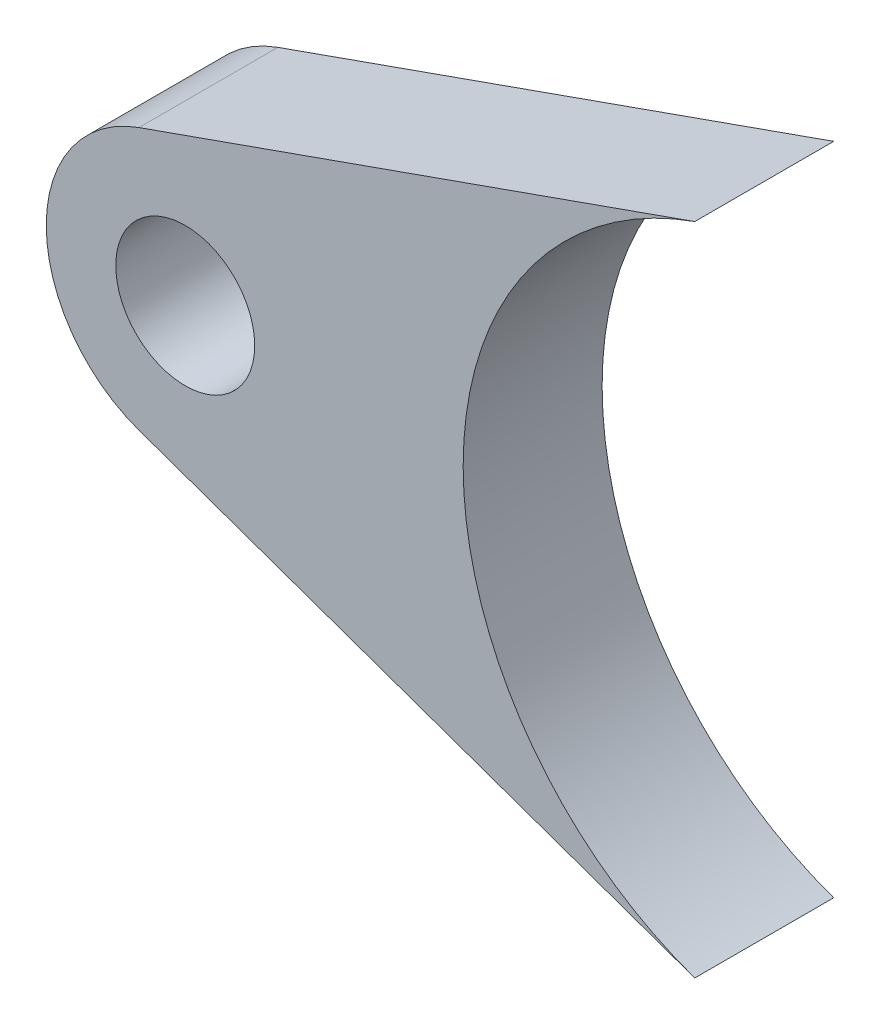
from build123d import *

# Parameters (mm, degrees)
SKETCH_1_R      = 10
EXTRUDE_1_DEPTH = 20


with BuildPart() as part:
    # Sketch 1 → Extrude 1 (new body)
    with BuildSketch(Plane.XY):
        with BuildLine():
            Line((-16.666666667, 47.140452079), (-96.666666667, 18.856180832))
            ThreePointArc((-96.666666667, 18.856180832), (-110, 0), (-96.666666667, -18.856180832))
            Line((-96.666666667, -18.856180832), (-16.666666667, -47.140452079))
            ThreePointArc((-16.666666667, -47.140452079), (-50, 0), (-16.666666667, 47.140452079))
        make_face()
        with Locations((-90, 0)):
            Circle(SKETCH_1_R, mode=Mode.SUBTRACT)
    extrude(amount=EXTRUDE_1_DEPTH)


solid = part.part
